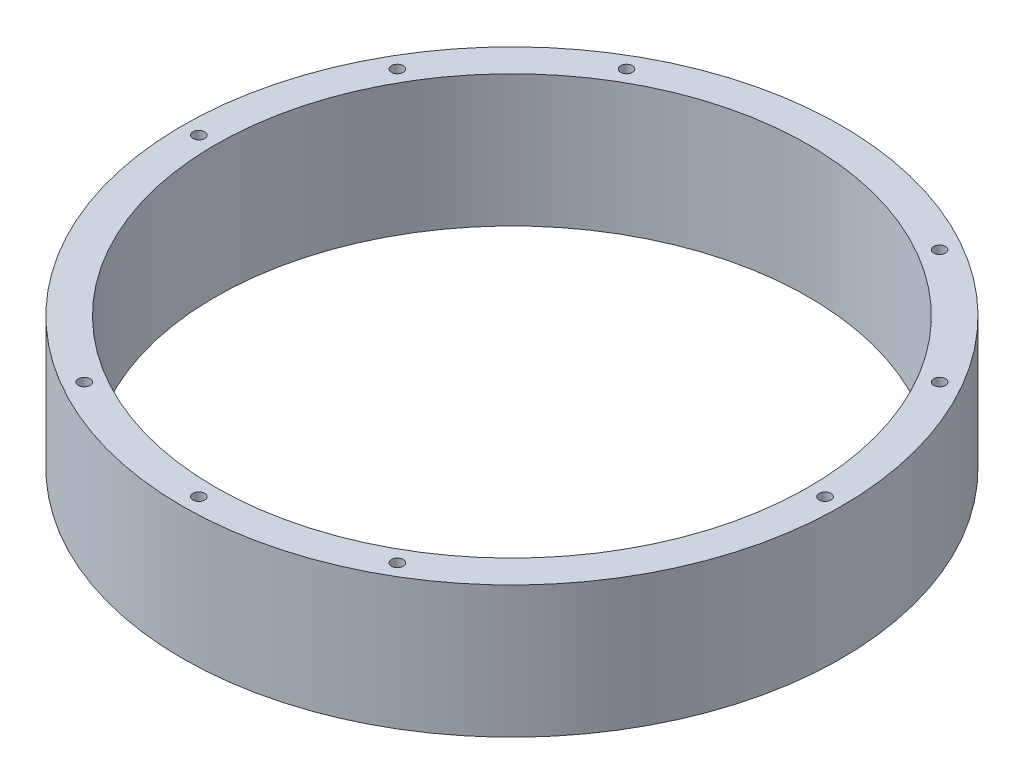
ISO-10303-21;
HEADER;
FILE_DESCRIPTION(('STEP AP214'),'2;1');
FILE_NAME('part.step','',(''),(''),'','','');
FILE_SCHEMA(('AUTOMOTIVE_DESIGN { 1 0 10303 214 1 1 1 1 }'));
ENDSEC;
DATA;
#1=APPLICATION_CONTEXT('core data for automotive mechanical design processes');
#2=APPLICATION_PROTOCOL_DEFINITION('international standard','automotive_design',2000,#1);
#3=PRODUCT_CONTEXT('',#1,'mechanical');
#4=PRODUCT('Part','Part','',(#3));
#5=PRODUCT_RELATED_PRODUCT_CATEGORY('part','',(#4));
#6=PRODUCT_DEFINITION_FORMATION('','',#4);
#7=PRODUCT_DEFINITION_CONTEXT('part definition',#1,'design');
#8=PRODUCT_DEFINITION('design','',#6,#7);
#9=PRODUCT_DEFINITION_SHAPE('','',#8);
#10=(LENGTH_UNIT() NAMED_UNIT(*) SI_UNIT(.MILLI.,.METRE.));
#11=(NAMED_UNIT(*) PLANE_ANGLE_UNIT() SI_UNIT($,.RADIAN.));
#12=(NAMED_UNIT(*) SI_UNIT($,.STERADIAN.) SOLID_ANGLE_UNIT());
#13=UNCERTAINTY_MEASURE_WITH_UNIT(LENGTH_MEASURE(1.E-05),#10,'distance_accuracy_value','');
#14=(GEOMETRIC_REPRESENTATION_CONTEXT(3) GLOBAL_UNCERTAINTY_ASSIGNED_CONTEXT((#13)) GLOBAL_UNIT_ASSIGNED_CONTEXT((#10,
#11,#12)) REPRESENTATION_CONTEXT('',''));
#15=CARTESIAN_POINT('',(0.,0.,0.));
#16=DIRECTION('',(0.,0.,1.));
#17=DIRECTION('',(1.,0.,0.));
#18=AXIS2_PLACEMENT_3D('',#15,#16,#17);
#19=CARTESIAN_POINT('',(0.,25.4,0.));
#20=DIRECTION('',(0.,1.,0.));
#21=DIRECTION('',(0.,0.,1.));
#22=AXIS2_PLACEMENT_3D('',#19,#20,#21);
#23=PLANE('',#22);
#24=CARTESIAN_POINT('',(0.,25.4,60.325));
#25=DIRECTION('',(0.,1.,0.));
#26=DIRECTION('',(0.,0.,1.));
#27=AXIS2_PLACEMENT_3D('',#24,#25,#26);
#28=CIRCLE('',#27,1.1303);
#29=CARTESIAN_POINT('',(0.,25.4,61.4553));
#30=VERTEX_POINT('',#29);
#31=EDGE_CURVE('E79',#30,#30,#28,.T.);
#32=ORIENTED_EDGE('',*,*,#31,.F.);
#33=EDGE_LOOP('',(#32));
#34=FACE_BOUND('',#33,.T.);
#35=CARTESIAN_POINT('',(-60.325,25.4,-1.94289029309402E-13));
#36=DIRECTION('',(0.,1.,0.));
#37=DIRECTION('',(0.,0.,1.));
#38=AXIS2_PLACEMENT_3D('',#35,#36,#37);
#39=CIRCLE('',#38,1.1303);
#40=CARTESIAN_POINT('',(-60.325,25.4,1.13029999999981));
#41=VERTEX_POINT('',#40);
#42=EDGE_CURVE('E87',#41,#41,#39,.T.);
#43=ORIENTED_EDGE('',*,*,#42,.F.);
#44=EDGE_LOOP('',(#43));
#45=FACE_BOUND('',#44,.T.);
#46=CARTESIAN_POINT('',(52.2429824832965,25.4,-30.1624999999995));
#47=DIRECTION('',(0.,1.,0.));
#48=DIRECTION('',(0.,0.,1.));
#49=AXIS2_PLACEMENT_3D('',#46,#47,#48);
#50=CIRCLE('',#49,1.1303);
#51=CARTESIAN_POINT('',(52.2429824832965,25.4,-29.0321999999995));
#52=VERTEX_POINT('',#51);
#53=EDGE_CURVE('E80',#52,#52,#50,.T.);
#54=ORIENTED_EDGE('',*,*,#53,.F.);
#55=EDGE_LOOP('',(#54));
#56=FACE_BOUND('',#55,.T.);
#57=CARTESIAN_POINT('',(60.325,25.4,6.21031004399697E-13));
#58=DIRECTION('',(0.,1.,0.));
#59=DIRECTION('',(0.,0.,1.));
#60=AXIS2_PLACEMENT_3D('',#57,#58,#59);
#61=CIRCLE('',#60,1.1303);
#62=CARTESIAN_POINT('',(60.325,25.4,1.13030000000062));
#63=VERTEX_POINT('',#62);
#64=EDGE_CURVE('E98',#63,#63,#61,.T.);
#65=ORIENTED_EDGE('',*,*,#64,.F.);
#66=EDGE_LOOP('',(#65));
#67=FACE_BOUND('',#66,.T.);
#68=CARTESIAN_POINT('',(30.1625000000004,25.4,-52.242982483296));
#69=DIRECTION('',(0.,1.,0.));
#70=DIRECTION('',(0.,0.,1.));
#71=AXIS2_PLACEMENT_3D('',#68,#69,#70);
#72=CIRCLE('',#71,1.1303);
#73=CARTESIAN_POINT('',(30.1625000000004,25.4,-51.112682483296));
#74=VERTEX_POINT('',#73);
#75=EDGE_CURVE('E92',#74,#74,#72,.T.);
#76=ORIENTED_EDGE('',*,*,#75,.F.);
#77=EDGE_LOOP('',(#76));
#78=FACE_BOUND('',#77,.T.);
#79=CARTESIAN_POINT('',(-30.1624999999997,25.4,-52.2429824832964));
#80=DIRECTION('',(0.,1.,0.));
#81=DIRECTION('',(0.,0.,1.));
#82=AXIS2_PLACEMENT_3D('',#79,#80,#81);
#83=CIRCLE('',#82,1.1303);
#84=CARTESIAN_POINT('',(-30.1624999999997,25.4,-51.1126824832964));
#85=VERTEX_POINT('',#84);
#86=EDGE_CURVE('E54',#85,#85,#83,.T.);
#87=ORIENTED_EDGE('',*,*,#86,.F.);
#88=EDGE_LOOP('',(#87));
#89=FACE_BOUND('',#88,.T.);
#90=CARTESIAN_POINT('',(-52.2429824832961,25.4,-30.1625000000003));
#91=DIRECTION('',(0.,1.,0.));
#92=DIRECTION('',(0.,0.,1.));
#93=AXIS2_PLACEMENT_3D('',#90,#91,#92);
#94=CIRCLE('',#93,1.1303);
#95=CARTESIAN_POINT('',(-52.2429824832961,25.4,-29.0322000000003));
#96=VERTEX_POINT('',#95);
#97=EDGE_CURVE('E61',#96,#96,#94,.T.);
#98=ORIENTED_EDGE('',*,*,#97,.F.);
#99=EDGE_LOOP('',(#98));
#100=FACE_BOUND('',#99,.T.);
#101=CARTESIAN_POINT('',(30.1625000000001,25.4,52.2429824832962));
#102=DIRECTION('',(0.,1.,0.));
#103=DIRECTION('',(0.,0.,1.));
#104=AXIS2_PLACEMENT_3D('',#101,#102,#103);
#105=CIRCLE('',#104,1.1303);
#106=CARTESIAN_POINT('',(30.1625000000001,25.4,53.3732824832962));
#107=VERTEX_POINT('',#106);
#108=EDGE_CURVE('E67',#107,#107,#105,.T.);
#109=ORIENTED_EDGE('',*,*,#108,.F.);
#110=EDGE_LOOP('',(#109));
#111=FACE_BOUND('',#110,.T.);
#112=CARTESIAN_POINT('',(-30.1625000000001,25.4,52.2429824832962));
#113=DIRECTION('',(0.,1.,0.));
#114=DIRECTION('',(0.,0.,1.));
#115=AXIS2_PLACEMENT_3D('',#112,#113,#114);
#116=CIRCLE('',#115,1.1303);
#117=CARTESIAN_POINT('',(-30.1625000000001,25.4,53.3732824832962));
#118=VERTEX_POINT('',#117);
#119=EDGE_CURVE('E73',#118,#118,#116,.T.);
#120=ORIENTED_EDGE('',*,*,#119,.F.);
#121=EDGE_LOOP('',(#120));
#122=FACE_BOUND('',#121,.T.);
#123=CARTESIAN_POINT('',(0.,25.4,0.));
#124=DIRECTION('',(0.,1.,0.));
#125=DIRECTION('',(0.,0.,1.));
#126=AXIS2_PLACEMENT_3D('',#123,#124,#125);
#127=CIRCLE('',#126,63.5);
#128=CARTESIAN_POINT('',(0.,25.4,63.5));
#129=VERTEX_POINT('',#128);
#130=EDGE_CURVE('E10',#129,#129,#127,.T.);
#131=ORIENTED_EDGE('',*,*,#130,.T.);
#132=EDGE_LOOP('',(#131));
#133=FACE_BOUND('',#132,.T.);
#134=CARTESIAN_POINT('',(0.,25.4,0.));
#135=DIRECTION('',(0.,1.,0.));
#136=DIRECTION('',(0.,0.,1.));
#137=AXIS2_PLACEMENT_3D('',#134,#135,#136);
#138=CIRCLE('',#137,57.15);
#139=CARTESIAN_POINT('',(0.,25.4,57.15));
#140=VERTEX_POINT('',#139);
#141=EDGE_CURVE('E46',#140,#140,#138,.T.);
#142=ORIENTED_EDGE('',*,*,#141,.F.);
#143=EDGE_LOOP('',(#142));
#144=FACE_BOUND('',#143,.T.);
#145=ADVANCED_FACE('F35',(#34,#45,#56,#67,#78,#89,#100,#111,#122,#133,#144),#23,.T.);
#146=CARTESIAN_POINT('',(0.,0.,0.));
#147=DIRECTION('',(0.,1.,0.));
#148=DIRECTION('',(0.,0.,1.));
#149=AXIS2_PLACEMENT_3D('',#146,#147,#148);
#150=PLANE('',#149);
#151=CARTESIAN_POINT('',(0.,0.,60.325));
#152=DIRECTION('',(0.,1.,0.));
#153=DIRECTION('',(0.,0.,1.));
#154=AXIS2_PLACEMENT_3D('',#151,#152,#153);
#155=CIRCLE('',#154,1.1303);
#156=CARTESIAN_POINT('',(0.,0.,61.4553));
#157=VERTEX_POINT('',#156);
#158=EDGE_CURVE('E51',#157,#157,#155,.T.);
#159=ORIENTED_EDGE('',*,*,#158,.T.);
#160=EDGE_LOOP('',(#159));
#161=FACE_BOUND('',#160,.T.);
#162=CARTESIAN_POINT('',(-60.325,0.,-1.94289029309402E-13));
#163=DIRECTION('',(0.,1.,0.));
#164=DIRECTION('',(0.,0.,1.));
#165=AXIS2_PLACEMENT_3D('',#162,#163,#164);
#166=CIRCLE('',#165,1.1303);
#167=CARTESIAN_POINT('',(-60.325,0.,1.13029999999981));
#168=VERTEX_POINT('',#167);
#169=EDGE_CURVE('E58',#168,#168,#166,.T.);
#170=ORIENTED_EDGE('',*,*,#169,.T.);
#171=EDGE_LOOP('',(#170));
#172=FACE_BOUND('',#171,.T.);
#173=CARTESIAN_POINT('',(52.2429824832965,0.,-30.1624999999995));
#174=DIRECTION('',(0.,1.,0.));
#175=DIRECTION('',(0.,0.,1.));
#176=AXIS2_PLACEMENT_3D('',#173,#174,#175);
#177=CIRCLE('',#176,1.1303);
#178=CARTESIAN_POINT('',(52.2429824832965,0.,-29.0321999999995));
#179=VERTEX_POINT('',#178);
#180=EDGE_CURVE('E83',#179,#179,#177,.T.);
#181=ORIENTED_EDGE('',*,*,#180,.T.);
#182=EDGE_LOOP('',(#181));
#183=FACE_BOUND('',#182,.T.);
#184=CARTESIAN_POINT('',(60.325,0.,6.21031004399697E-13));
#185=DIRECTION('',(0.,1.,0.));
#186=DIRECTION('',(0.,0.,1.));
#187=AXIS2_PLACEMENT_3D('',#184,#185,#186);
#188=CIRCLE('',#187,1.1303);
#189=CARTESIAN_POINT('',(60.325,0.,1.13030000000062));
#190=VERTEX_POINT('',#189);
#191=EDGE_CURVE('E84',#190,#190,#188,.T.);
#192=ORIENTED_EDGE('',*,*,#191,.T.);
#193=EDGE_LOOP('',(#192));
#194=FACE_BOUND('',#193,.T.);
#195=CARTESIAN_POINT('',(30.1625000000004,0.,-52.242982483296));
#196=DIRECTION('',(0.,1.,0.));
#197=DIRECTION('',(0.,0.,1.));
#198=AXIS2_PLACEMENT_3D('',#195,#196,#197);
#199=CIRCLE('',#198,1.1303);
#200=CARTESIAN_POINT('',(30.1625000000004,0.,-51.112682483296));
#201=VERTEX_POINT('',#200);
#202=EDGE_CURVE('E95',#201,#201,#199,.T.);
#203=ORIENTED_EDGE('',*,*,#202,.T.);
#204=EDGE_LOOP('',(#203));
#205=FACE_BOUND('',#204,.T.);
#206=CARTESIAN_POINT('',(-30.1624999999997,0.,-52.2429824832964));
#207=DIRECTION('',(0.,1.,0.));
#208=DIRECTION('',(0.,0.,1.));
#209=AXIS2_PLACEMENT_3D('',#206,#207,#208);
#210=CIRCLE('',#209,1.1303);
#211=CARTESIAN_POINT('',(-30.1624999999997,0.,-51.1126824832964));
#212=VERTEX_POINT('',#211);
#213=EDGE_CURVE('E57',#212,#212,#210,.T.);
#214=ORIENTED_EDGE('',*,*,#213,.T.);
#215=EDGE_LOOP('',(#214));
#216=FACE_BOUND('',#215,.T.);
#217=CARTESIAN_POINT('',(-52.2429824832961,0.,-30.1625000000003));
#218=DIRECTION('',(0.,1.,0.));
#219=DIRECTION('',(0.,0.,1.));
#220=AXIS2_PLACEMENT_3D('',#217,#218,#219);
#221=CIRCLE('',#220,1.1303);
#222=CARTESIAN_POINT('',(-52.2429824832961,0.,-29.0322000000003));
#223=VERTEX_POINT('',#222);
#224=EDGE_CURVE('E64',#223,#223,#221,.T.);
#225=ORIENTED_EDGE('',*,*,#224,.T.);
#226=EDGE_LOOP('',(#225));
#227=FACE_BOUND('',#226,.T.);
#228=CARTESIAN_POINT('',(30.1625000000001,0.,52.2429824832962));
#229=DIRECTION('',(0.,1.,0.));
#230=DIRECTION('',(0.,0.,1.));
#231=AXIS2_PLACEMENT_3D('',#228,#229,#230);
#232=CIRCLE('',#231,1.1303);
#233=CARTESIAN_POINT('',(30.1625000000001,0.,53.3732824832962));
#234=VERTEX_POINT('',#233);
#235=EDGE_CURVE('E70',#234,#234,#232,.T.);
#236=ORIENTED_EDGE('',*,*,#235,.T.);
#237=EDGE_LOOP('',(#236));
#238=FACE_BOUND('',#237,.T.);
#239=CARTESIAN_POINT('',(-30.1625000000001,0.,52.2429824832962));
#240=DIRECTION('',(0.,1.,0.));
#241=DIRECTION('',(0.,0.,1.));
#242=AXIS2_PLACEMENT_3D('',#239,#240,#241);
#243=CIRCLE('',#242,1.1303);
#244=CARTESIAN_POINT('',(-30.1625000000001,0.,53.3732824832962));
#245=VERTEX_POINT('',#244);
#246=EDGE_CURVE('E76',#245,#245,#243,.T.);
#247=ORIENTED_EDGE('',*,*,#246,.T.);
#248=EDGE_LOOP('',(#247));
#249=FACE_BOUND('',#248,.T.);
#250=CARTESIAN_POINT('',(0.,0.,0.));
#251=DIRECTION('',(0.,1.,0.));
#252=DIRECTION('',(0.,0.,1.));
#253=AXIS2_PLACEMENT_3D('',#250,#251,#252);
#254=CIRCLE('',#253,63.5);
#255=CARTESIAN_POINT('',(0.,0.,63.5));
#256=VERTEX_POINT('',#255);
#257=EDGE_CURVE('E39',#256,#256,#254,.T.);
#258=ORIENTED_EDGE('',*,*,#257,.F.);
#259=EDGE_LOOP('',(#258));
#260=FACE_BOUND('',#259,.T.);
#261=CARTESIAN_POINT('',(0.,0.,0.));
#262=DIRECTION('',(0.,1.,0.));
#263=DIRECTION('',(0.,0.,1.));
#264=AXIS2_PLACEMENT_3D('',#261,#262,#263);
#265=CIRCLE('',#264,57.15);
#266=CARTESIAN_POINT('',(0.,0.,57.15));
#267=VERTEX_POINT('',#266);
#268=EDGE_CURVE('E48',#267,#267,#265,.T.);
#269=ORIENTED_EDGE('',*,*,#268,.T.);
#270=EDGE_LOOP('',(#269));
#271=FACE_BOUND('',#270,.T.);
#272=ADVANCED_FACE('F108',(#161,#172,#183,#194,#205,#216,#227,#238,#249,#260,#271),#150,.F.);
#273=CARTESIAN_POINT('',(0.,25.4,0.));
#274=DIRECTION('',(0.,-1.,0.));
#275=DIRECTION('',(0.,0.,-1.));
#276=AXIS2_PLACEMENT_3D('',#273,#274,#275);
#277=CYLINDRICAL_SURFACE('',#276,63.5);
#278=ORIENTED_EDGE('',*,*,#130,.F.);
#279=EDGE_LOOP('',(#278));
#280=FACE_BOUND('',#279,.T.);
#281=ORIENTED_EDGE('',*,*,#257,.T.);
#282=EDGE_LOOP('',(#281));
#283=FACE_BOUND('',#282,.T.);
#284=ADVANCED_FACE('F37',(#280,#283),#277,.T.);
#285=CARTESIAN_POINT('',(0.,25.4,0.));
#286=DIRECTION('',(0.,-1.,0.));
#287=DIRECTION('',(0.,0.,-1.));
#288=AXIS2_PLACEMENT_3D('',#285,#286,#287);
#289=CYLINDRICAL_SURFACE('',#288,57.15);
#290=ORIENTED_EDGE('',*,*,#141,.T.);
#291=EDGE_LOOP('',(#290));
#292=FACE_BOUND('',#291,.T.);
#293=ORIENTED_EDGE('',*,*,#268,.F.);
#294=EDGE_LOOP('',(#293));
#295=FACE_BOUND('',#294,.T.);
#296=ADVANCED_FACE('F139',(#292,#295),#289,.F.);
#297=CARTESIAN_POINT('',(-30.1625000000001,0.,52.2429824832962));
#298=DIRECTION('',(0.,1.,0.));
#299=DIRECTION('',(0.,0.,1.));
#300=AXIS2_PLACEMENT_3D('',#297,#298,#299);
#301=CYLINDRICAL_SURFACE('',#300,1.1303);
#302=ORIENTED_EDGE('',*,*,#246,.F.);
#303=EDGE_LOOP('',(#302));
#304=FACE_BOUND('',#303,.T.);
#305=ORIENTED_EDGE('',*,*,#119,.T.);
#306=EDGE_LOOP('',(#305));
#307=FACE_BOUND('',#306,.T.);
#308=ADVANCED_FACE('F142',(#304,#307),#301,.F.);
#309=CARTESIAN_POINT('',(30.1625000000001,0.,52.2429824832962));
#310=DIRECTION('',(0.,1.,0.));
#311=DIRECTION('',(0.,0.,1.));
#312=AXIS2_PLACEMENT_3D('',#309,#310,#311);
#313=CYLINDRICAL_SURFACE('',#312,1.1303);
#314=ORIENTED_EDGE('',*,*,#235,.F.);
#315=EDGE_LOOP('',(#314));
#316=FACE_BOUND('',#315,.T.);
#317=ORIENTED_EDGE('',*,*,#108,.T.);
#318=EDGE_LOOP('',(#317));
#319=FACE_BOUND('',#318,.T.);
#320=ADVANCED_FACE('F160',(#316,#319),#313,.F.);
#321=CARTESIAN_POINT('',(-52.2429824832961,0.,-30.1625000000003));
#322=DIRECTION('',(0.,1.,0.));
#323=DIRECTION('',(0.,0.,1.));
#324=AXIS2_PLACEMENT_3D('',#321,#322,#323);
#325=CYLINDRICAL_SURFACE('',#324,1.1303);
#326=ORIENTED_EDGE('',*,*,#224,.F.);
#327=EDGE_LOOP('',(#326));
#328=FACE_BOUND('',#327,.T.);
#329=ORIENTED_EDGE('',*,*,#97,.T.);
#330=EDGE_LOOP('',(#329));
#331=FACE_BOUND('',#330,.T.);
#332=ADVANCED_FACE('F156',(#328,#331),#325,.F.);
#333=CARTESIAN_POINT('',(-30.1624999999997,0.,-52.2429824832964));
#334=DIRECTION('',(0.,1.,0.));
#335=DIRECTION('',(0.,0.,1.));
#336=AXIS2_PLACEMENT_3D('',#333,#334,#335);
#337=CYLINDRICAL_SURFACE('',#336,1.1303);
#338=ORIENTED_EDGE('',*,*,#213,.F.);
#339=EDGE_LOOP('',(#338));
#340=FACE_BOUND('',#339,.T.);
#341=ORIENTED_EDGE('',*,*,#86,.T.);
#342=EDGE_LOOP('',(#341));
#343=FACE_BOUND('',#342,.T.);
#344=ADVANCED_FACE('F152',(#340,#343),#337,.F.);
#345=CARTESIAN_POINT('',(30.1625000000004,0.,-52.242982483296));
#346=DIRECTION('',(0.,1.,0.));
#347=DIRECTION('',(0.,0.,1.));
#348=AXIS2_PLACEMENT_3D('',#345,#346,#347);
#349=CYLINDRICAL_SURFACE('',#348,1.1303);
#350=ORIENTED_EDGE('',*,*,#202,.F.);
#351=EDGE_LOOP('',(#350));
#352=FACE_BOUND('',#351,.T.);
#353=ORIENTED_EDGE('',*,*,#75,.T.);
#354=EDGE_LOOP('',(#353));
#355=FACE_BOUND('',#354,.T.);
#356=ADVANCED_FACE('F155',(#352,#355),#349,.F.);
#357=CARTESIAN_POINT('',(60.325,0.,6.21031004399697E-13));
#358=DIRECTION('',(0.,1.,0.));
#359=DIRECTION('',(0.,0.,1.));
#360=AXIS2_PLACEMENT_3D('',#357,#358,#359);
#361=CYLINDRICAL_SURFACE('',#360,1.1303);
#362=ORIENTED_EDGE('',*,*,#191,.F.);
#363=EDGE_LOOP('',(#362));
#364=FACE_BOUND('',#363,.T.);
#365=ORIENTED_EDGE('',*,*,#64,.T.);
#366=EDGE_LOOP('',(#365));
#367=FACE_BOUND('',#366,.T.);
#368=ADVANCED_FACE('F171',(#364,#367),#361,.F.);
#369=CARTESIAN_POINT('',(52.2429824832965,0.,-30.1624999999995));
#370=DIRECTION('',(0.,1.,0.));
#371=DIRECTION('',(0.,0.,1.));
#372=AXIS2_PLACEMENT_3D('',#369,#370,#371);
#373=CYLINDRICAL_SURFACE('',#372,1.1303);
#374=ORIENTED_EDGE('',*,*,#180,.F.);
#375=EDGE_LOOP('',(#374));
#376=FACE_BOUND('',#375,.T.);
#377=ORIENTED_EDGE('',*,*,#53,.T.);
#378=EDGE_LOOP('',(#377));
#379=FACE_BOUND('',#378,.T.);
#380=ADVANCED_FACE('F168',(#376,#379),#373,.F.);
#381=CARTESIAN_POINT('',(-60.325,0.,-1.94289029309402E-13));
#382=DIRECTION('',(0.,1.,0.));
#383=DIRECTION('',(0.,0.,1.));
#384=AXIS2_PLACEMENT_3D('',#381,#382,#383);
#385=CYLINDRICAL_SURFACE('',#384,1.1303);
#386=ORIENTED_EDGE('',*,*,#169,.F.);
#387=EDGE_LOOP('',(#386));
#388=FACE_BOUND('',#387,.T.);
#389=ORIENTED_EDGE('',*,*,#42,.T.);
#390=EDGE_LOOP('',(#389));
#391=FACE_BOUND('',#390,.T.);
#392=ADVANCED_FACE('F114',(#388,#391),#385,.F.);
#393=CARTESIAN_POINT('',(0.,0.,60.325));
#394=DIRECTION('',(0.,1.,0.));
#395=DIRECTION('',(0.,0.,1.));
#396=AXIS2_PLACEMENT_3D('',#393,#394,#395);
#397=CYLINDRICAL_SURFACE('',#396,1.1303);
#398=ORIENTED_EDGE('',*,*,#158,.F.);
#399=EDGE_LOOP('',(#398));
#400=FACE_BOUND('',#399,.T.);
#401=ORIENTED_EDGE('',*,*,#31,.T.);
#402=EDGE_LOOP('',(#401));
#403=FACE_BOUND('',#402,.T.);
#404=ADVANCED_FACE('F111',(#400,#403),#397,.F.);
#405=CLOSED_SHELL('',(#145,#272,#284,#296,#308,#320,#332,#344,#356,#368,#380,#392,#404));
#406=MANIFOLD_SOLID_BREP('B2',#405);
#407=ADVANCED_BREP_SHAPE_REPRESENTATION('',(#18,#406),#14);
#408=SHAPE_DEFINITION_REPRESENTATION(#9,#407);
ENDSEC;
END-ISO-10303-21;
